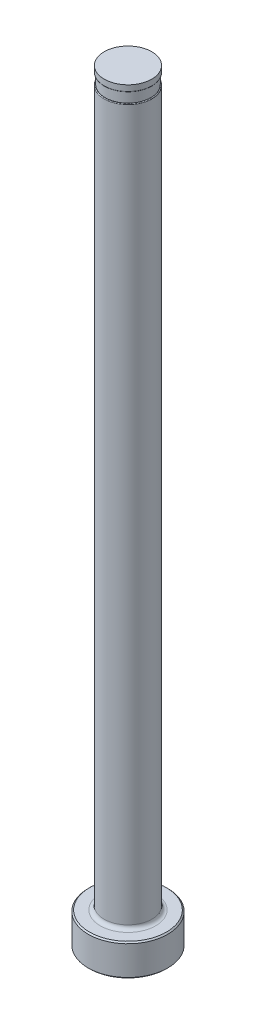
from build123d import *

# Parameters (mm, degrees)
CHAMFER1_SIZE     = 0.254
FILLET1_R         = 0.762
SKETCH2_W         = 0.2032
SKETCH2_H         = 2.032
D_SLOT_DEPTH      = 153.812852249
D_SLOT_DEPTH_BACK = 153.812852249
SKETCH5_W         = 0.0127
SKETCH5_H         = 1.27
FILLET2_R         = 0.127


with BuildPart() as part:
    # Sketch1 → Revolve1 (revolve)
    with BuildSketch(Plane.XY, mode=Mode.PRIVATE) as revolve1_sk:
        Polygon((0, 0), (-7.9375, 0), (-7.9375, 6.35), (-4.7625, 6.35), (-4.7625, 152.4), (0, 152.4), align=None)
    revolve(revolve1_sk.sketch.rotate(Axis((0, 259.958771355, 0), (0, -1, 0)), 270), axis=Axis((0, 259.958771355, 0), (0, -1, 0)))

    # Chamfer1
    chamfer1_edges = [part.edges().sort_by_distance(p)[0] for p in [
        (0, 6.35, -7.9375),
        (0, 0, -7.9375),
    ]]
    chamfer(chamfer1_edges, length=CHAMFER1_SIZE)

    # Fillet1
    fillet1_edges = [part.edges().sort_by_distance(p)[0] for p in [
        (0, 6.35, -4.7625),
    ]]
    fillet(fillet1_edges, radius=FILLET1_R)

    # Sketch2 → Vent Relief (revolve, cut)
    with BuildSketch(Plane.XY, mode=Mode.PRIVATE) as vent_relief_sk:
        with Locations((-4.6609, 150.114)):
            Rectangle(SKETCH2_W, SKETCH2_H)
    revolve(vent_relief_sk.sketch.rotate(Axis((0, 153.448281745, 0), (0, -1, 0)), 270), axis=Axis((0, 153.448281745, 0), (0, -1, 0)), mode=Mode.SUBTRACT)

    # Sketch3 → D-Slot (cut, two sides: drawn at the far end of the back side and taken through both)
    with BuildSketch(Plane.XY.offset(-D_SLOT_DEPTH_BACK)):
        with BuildLine():
            Line((-4.5593, 150.114), (-4.5593, 86.614))
            ThreePointArc((-4.5593, 86.614), (-4.610513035, 86.046038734), (-4.7625, 85.4964))
            Line((-4.7625, 85.4964), (-4.7625, 150.114))
            Line((-4.7625, 150.114), (-4.5593, 150.114))
        make_face()
    extrude(amount=D_SLOT_DEPTH + D_SLOT_DEPTH_BACK, mode=Mode.SUBTRACT)

    # Sketch5 → Vent Diameter (revolve, cut)
    with BuildSketch(Plane.XY, mode=Mode.PRIVATE) as vent_diameter_sk:
        with Locations((-4.75615, 151.765)):
            Rectangle(SKETCH5_W, SKETCH5_H)
    revolve(vent_diameter_sk.sketch.rotate(Axis((0, 152.687735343, 0), (0, -1, 0)), 90), axis=Axis((0, 152.687735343, 0), (0, -1, 0)), mode=Mode.SUBTRACT)

    # Fillet2
    fillet2_edges = [part.edges().sort_by_distance(p)[0] for p in [
        (3.823350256, 149.098, -2.839612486),
        (0, 151.13, 4.7498),
    ]]
    fillet(fillet2_edges, radius=FILLET2_R)


solid = part.part
